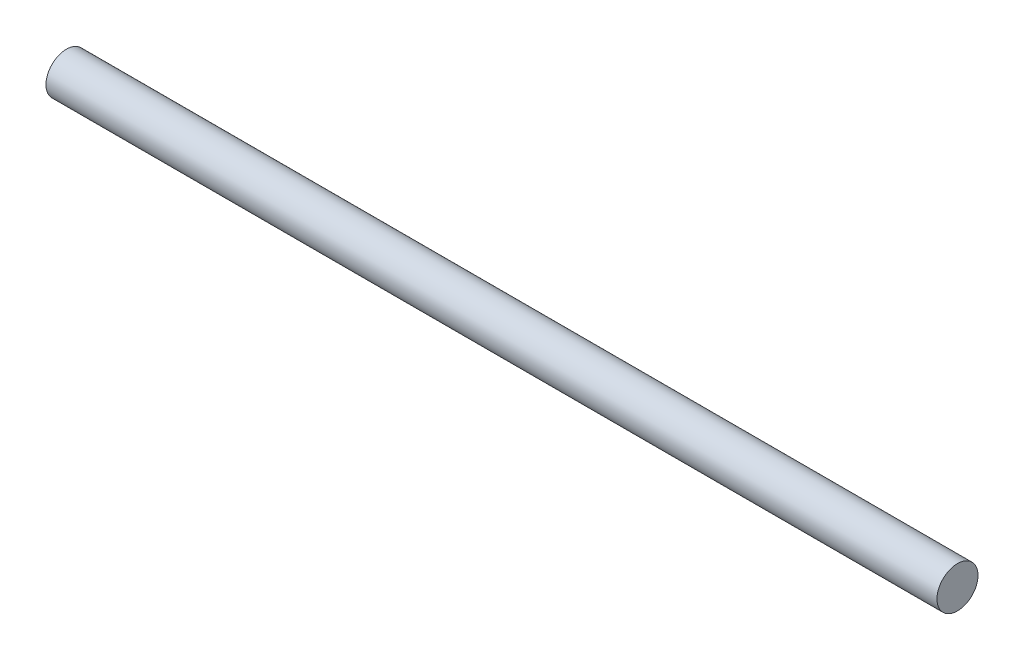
from build123d import *

# Parameters (mm, degrees)
SKETCH2_R          = 2.413
BASE_EXTRUDE_DEPTH = 104.775


with BuildPart() as part:
    # Sketch2 → Base-Extrude (new body)
    with BuildSketch(Plane(origin=(0, 0, 0), x_dir=(0, 0, -1), z_dir=(1, 0, 0))):
        Circle(SKETCH2_R)
    extrude(amount=BASE_EXTRUDE_DEPTH)


solid = part.part
